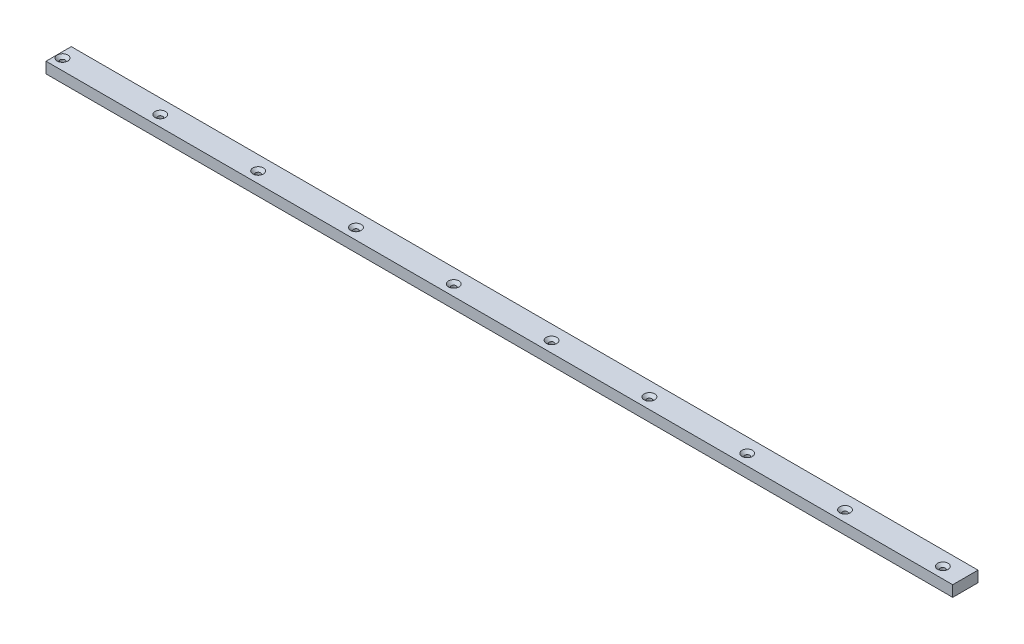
ISO-10303-21;
HEADER;
FILE_DESCRIPTION(('STEP AP214'),'2;1');
FILE_NAME('part.step','',(''),(''),'','','');
FILE_SCHEMA(('AUTOMOTIVE_DESIGN { 1 0 10303 214 1 1 1 1 }'));
ENDSEC;
DATA;
#1=APPLICATION_CONTEXT('core data for automotive mechanical design processes');
#2=APPLICATION_PROTOCOL_DEFINITION('international standard','automotive_design',2000,#1);
#3=PRODUCT_CONTEXT('',#1,'mechanical');
#4=PRODUCT('Part','Part','',(#3));
#5=PRODUCT_RELATED_PRODUCT_CATEGORY('part','',(#4));
#6=PRODUCT_DEFINITION_FORMATION('','',#4);
#7=PRODUCT_DEFINITION_CONTEXT('part definition',#1,'design');
#8=PRODUCT_DEFINITION('design','',#6,#7);
#9=PRODUCT_DEFINITION_SHAPE('','',#8);
#10=(LENGTH_UNIT() NAMED_UNIT(*) SI_UNIT(.MILLI.,.METRE.));
#11=(NAMED_UNIT(*) PLANE_ANGLE_UNIT() SI_UNIT($,.RADIAN.));
#12=(NAMED_UNIT(*) SI_UNIT($,.STERADIAN.) SOLID_ANGLE_UNIT());
#13=UNCERTAINTY_MEASURE_WITH_UNIT(LENGTH_MEASURE(1.E-05),#10,'distance_accuracy_value','');
#14=(GEOMETRIC_REPRESENTATION_CONTEXT(3) GLOBAL_UNCERTAINTY_ASSIGNED_CONTEXT((#13)) GLOBAL_UNIT_ASSIGNED_CONTEXT((#10,
#11,#12)) REPRESENTATION_CONTEXT('',''));
#15=CARTESIAN_POINT('',(0.,0.,0.));
#16=DIRECTION('',(0.,0.,1.));
#17=DIRECTION('',(1.,0.,0.));
#18=AXIS2_PLACEMENT_3D('',#15,#16,#17);
#19=CARTESIAN_POINT('',(-318.5,9.99999999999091,1.5));
#20=DIRECTION('',(0.,1.,0.));
#21=DIRECTION('',(0.,0.,1.));
#22=AXIS2_PLACEMENT_3D('',#19,#20,#21);
#23=CONICAL_SURFACE('',#22,4.79999999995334,0.785398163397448);
#24=CARTESIAN_POINT('',(-318.5,7.45,1.5));
#25=DIRECTION('',(0.,1.,0.));
#26=DIRECTION('',(0.,0.,1.));
#27=AXIS2_PLACEMENT_3D('',#24,#25,#26);
#28=CIRCLE('',#27,2.24999999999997);
#29=CARTESIAN_POINT('',(-318.5,7.45,3.74999999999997));
#30=VERTEX_POINT('',#29);
#31=EDGE_CURVE('E111',#30,#30,#28,.F.);
#32=ORIENTED_EDGE('',*,*,#31,.T.);
#33=EDGE_LOOP('',(#32));
#34=FACE_BOUND('',#33,.T.);
#35=CARTESIAN_POINT('',(-318.5,9.99999999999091,1.5));
#36=DIRECTION('',(0.,1.,0.));
#37=DIRECTION('',(0.,0.,1.));
#38=AXIS2_PLACEMENT_3D('',#35,#36,#37);
#39=CIRCLE('',#38,4.79999999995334);
#40=CARTESIAN_POINT('',(-318.5,9.99999999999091,6.29999999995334));
#41=VERTEX_POINT('',#40);
#42=EDGE_CURVE('E20',#41,#41,#39,.F.);
#43=ORIENTED_EDGE('',*,*,#42,.F.);
#44=EDGE_LOOP('',(#43));
#45=FACE_BOUND('',#44,.T.);
#46=ADVANCED_FACE('F17',(#34,#45),#23,.F.);
#47=CARTESIAN_POINT('',(-407.5,9.99999999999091,1.5));
#48=DIRECTION('',(0.,1.,0.));
#49=DIRECTION('',(0.,0.,1.));
#50=AXIS2_PLACEMENT_3D('',#47,#48,#49);
#51=CONICAL_SURFACE('',#50,4.79999999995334,0.785398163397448);
#52=CARTESIAN_POINT('',(-407.5,7.45,1.5));
#53=DIRECTION('',(0.,1.,0.));
#54=DIRECTION('',(0.,0.,1.));
#55=AXIS2_PLACEMENT_3D('',#52,#53,#54);
#56=CIRCLE('',#55,2.24999999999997);
#57=CARTESIAN_POINT('',(-407.5,7.45,3.74999999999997));
#58=VERTEX_POINT('',#57);
#59=EDGE_CURVE('E68',#58,#58,#56,.F.);
#60=ORIENTED_EDGE('',*,*,#59,.T.);
#61=EDGE_LOOP('',(#60));
#62=FACE_BOUND('',#61,.T.);
#63=CARTESIAN_POINT('',(-407.5,9.99999999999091,1.5));
#64=DIRECTION('',(0.,1.,0.));
#65=DIRECTION('',(0.,0.,1.));
#66=AXIS2_PLACEMENT_3D('',#63,#64,#65);
#67=CIRCLE('',#66,4.79999999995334);
#68=CARTESIAN_POINT('',(-407.5,9.99999999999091,6.29999999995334));
#69=VERTEX_POINT('',#68);
#70=EDGE_CURVE('E163',#69,#69,#67,.F.);
#71=ORIENTED_EDGE('',*,*,#70,.F.);
#72=EDGE_LOOP('',(#71));
#73=FACE_BOUND('',#72,.T.);
#74=ADVANCED_FACE('F171',(#62,#73),#51,.F.);
#75=CARTESIAN_POINT('',(0.,10.,0.));
#76=DIRECTION('',(0.,1.,0.));
#77=DIRECTION('',(0.,0.,1.));
#78=AXIS2_PLACEMENT_3D('',#75,#76,#77);
#79=PLANE('',#78);
#80=CARTESIAN_POINT('',(393.5,9.99999999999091,1.5));
#81=DIRECTION('',(0.,1.,0.));
#82=DIRECTION('',(0.,0.,1.));
#83=AXIS2_PLACEMENT_3D('',#80,#81,#82);
#84=CIRCLE('',#83,4.79999999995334);
#85=CARTESIAN_POINT('',(393.5,9.99999999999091,6.29999999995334));
#86=VERTEX_POINT('',#85);
#87=EDGE_CURVE('E113',#86,#86,#84,.F.);
#88=ORIENTED_EDGE('',*,*,#87,.T.);
#89=EDGE_LOOP('',(#88));
#90=FACE_BOUND('',#89,.T.);
#91=CARTESIAN_POINT('',(304.5,9.99999999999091,1.5));
#92=DIRECTION('',(0.,1.,0.));
#93=DIRECTION('',(0.,0.,1.));
#94=AXIS2_PLACEMENT_3D('',#91,#92,#93);
#95=CIRCLE('',#94,4.79999999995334);
#96=CARTESIAN_POINT('',(304.5,9.99999999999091,6.29999999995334));
#97=VERTEX_POINT('',#96);
#98=EDGE_CURVE('E143',#97,#97,#95,.F.);
#99=ORIENTED_EDGE('',*,*,#98,.T.);
#100=EDGE_LOOP('',(#99));
#101=FACE_BOUND('',#100,.T.);
#102=CARTESIAN_POINT('',(215.5,9.99999999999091,1.5));
#103=DIRECTION('',(0.,1.,0.));
#104=DIRECTION('',(0.,0.,1.));
#105=AXIS2_PLACEMENT_3D('',#102,#103,#104);
#106=CIRCLE('',#105,4.79999999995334);
#107=CARTESIAN_POINT('',(215.5,9.99999999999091,6.29999999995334));
#108=VERTEX_POINT('',#107);
#109=EDGE_CURVE('E146',#108,#108,#106,.F.);
#110=ORIENTED_EDGE('',*,*,#109,.T.);
#111=EDGE_LOOP('',(#110));
#112=FACE_BOUND('',#111,.T.);
#113=CARTESIAN_POINT('',(126.5,9.99999999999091,1.5));
#114=DIRECTION('',(0.,1.,0.));
#115=DIRECTION('',(0.,0.,1.));
#116=AXIS2_PLACEMENT_3D('',#113,#114,#115);
#117=CIRCLE('',#116,4.79999999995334);
#118=CARTESIAN_POINT('',(126.5,9.99999999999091,6.29999999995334));
#119=VERTEX_POINT('',#118);
#120=EDGE_CURVE('E149',#119,#119,#117,.F.);
#121=ORIENTED_EDGE('',*,*,#120,.T.);
#122=EDGE_LOOP('',(#121));
#123=FACE_BOUND('',#122,.T.);
#124=CARTESIAN_POINT('',(37.5000000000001,9.99999999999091,1.5));
#125=DIRECTION('',(0.,1.,0.));
#126=DIRECTION('',(0.,0.,1.));
#127=AXIS2_PLACEMENT_3D('',#124,#125,#126);
#128=CIRCLE('',#127,4.79999999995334);
#129=CARTESIAN_POINT('',(37.5000000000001,9.99999999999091,6.29999999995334));
#130=VERTEX_POINT('',#129);
#131=EDGE_CURVE('E152',#130,#130,#128,.F.);
#132=ORIENTED_EDGE('',*,*,#131,.T.);
#133=EDGE_LOOP('',(#132));
#134=FACE_BOUND('',#133,.T.);
#135=CARTESIAN_POINT('',(-51.4999999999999,9.99999999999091,1.5));
#136=DIRECTION('',(0.,1.,0.));
#137=DIRECTION('',(0.,0.,1.));
#138=AXIS2_PLACEMENT_3D('',#135,#136,#137);
#139=CIRCLE('',#138,4.79999999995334);
#140=CARTESIAN_POINT('',(-51.4999999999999,9.99999999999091,6.29999999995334));
#141=VERTEX_POINT('',#140);
#142=EDGE_CURVE('E155',#141,#141,#139,.F.);
#143=ORIENTED_EDGE('',*,*,#142,.T.);
#144=EDGE_LOOP('',(#143));
#145=FACE_BOUND('',#144,.T.);
#146=CARTESIAN_POINT('',(-140.5,9.99999999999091,1.5));
#147=DIRECTION('',(0.,1.,0.));
#148=DIRECTION('',(0.,0.,1.));
#149=AXIS2_PLACEMENT_3D('',#146,#147,#148);
#150=CIRCLE('',#149,4.79999999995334);
#151=CARTESIAN_POINT('',(-140.5,9.99999999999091,6.29999999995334));
#152=VERTEX_POINT('',#151);
#153=EDGE_CURVE('E158',#152,#152,#150,.F.);
#154=ORIENTED_EDGE('',*,*,#153,.T.);
#155=EDGE_LOOP('',(#154));
#156=FACE_BOUND('',#155,.T.);
#157=CARTESIAN_POINT('',(-229.5,9.99999999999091,1.5));
#158=DIRECTION('',(0.,1.,0.));
#159=DIRECTION('',(0.,0.,1.));
#160=AXIS2_PLACEMENT_3D('',#157,#158,#159);
#161=CIRCLE('',#160,4.79999999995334);
#162=CARTESIAN_POINT('',(-229.5,9.99999999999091,6.29999999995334));
#163=VERTEX_POINT('',#162);
#164=EDGE_CURVE('E161',#163,#163,#161,.F.);
#165=ORIENTED_EDGE('',*,*,#164,.T.);
#166=EDGE_LOOP('',(#165));
#167=FACE_BOUND('',#166,.T.);
#168=DIRECTION('',(0.,0.,-1.));
#169=VECTOR('',#168,1.);
#170=CARTESIAN_POINT('',(-412.5,10.,-11.5));
#171=LINE('',#170,#169);
#172=CARTESIAN_POINT('',(-412.5,10.,-11.5));
#173=VERTEX_POINT('',#172);
#174=CARTESIAN_POINT('',(-412.5,10.,11.5));
#175=VERTEX_POINT('',#174);
#176=EDGE_CURVE('E56',#173,#175,#171,.F.);
#177=ORIENTED_EDGE('',*,*,#176,.T.);
#178=DIRECTION('',(-1.,0.,0.));
#179=VECTOR('',#178,1.);
#180=CARTESIAN_POINT('',(-412.5,10.,11.5));
#181=LINE('',#180,#179);
#182=CARTESIAN_POINT('',(412.5,10.,11.5));
#183=VERTEX_POINT('',#182);
#184=EDGE_CURVE('E480',#175,#183,#181,.F.);
#185=ORIENTED_EDGE('',*,*,#184,.T.);
#186=DIRECTION('',(0.,0.,1.));
#187=VECTOR('',#186,1.);
#188=CARTESIAN_POINT('',(412.5,10.,-11.5));
#189=LINE('',#188,#187);
#190=CARTESIAN_POINT('',(412.5,10.,-11.5));
#191=VERTEX_POINT('',#190);
#192=EDGE_CURVE('E62',#183,#191,#189,.F.);
#193=ORIENTED_EDGE('',*,*,#192,.T.);
#194=DIRECTION('',(1.,0.,0.));
#195=VECTOR('',#194,1.);
#196=CARTESIAN_POINT('',(-412.5,10.,-11.5));
#197=LINE('',#196,#195);
#198=EDGE_CURVE('E59',#191,#173,#197,.F.);
#199=ORIENTED_EDGE('',*,*,#198,.T.);
#200=EDGE_LOOP('',(#177,#185,#193,#199));
#201=FACE_BOUND('',#200,.T.);
#202=ORIENTED_EDGE('',*,*,#70,.T.);
#203=EDGE_LOOP('',(#202));
#204=FACE_BOUND('',#203,.T.);
#205=ORIENTED_EDGE('',*,*,#42,.T.);
#206=EDGE_LOOP('',(#205));
#207=FACE_BOUND('',#206,.T.);
#208=ADVANCED_FACE('F60',(#90,#101,#112,#123,#134,#145,#156,#167,#201,#204,#207),#79,.T.);
#209=CARTESIAN_POINT('',(-229.5,9.99999999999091,1.5));
#210=DIRECTION('',(0.,1.,0.));
#211=DIRECTION('',(0.,0.,1.));
#212=AXIS2_PLACEMENT_3D('',#209,#210,#211);
#213=CONICAL_SURFACE('',#212,4.79999999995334,0.785398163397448);
#214=CARTESIAN_POINT('',(-229.5,7.45,1.5));
#215=DIRECTION('',(0.,1.,0.));
#216=DIRECTION('',(0.,0.,1.));
#217=AXIS2_PLACEMENT_3D('',#214,#215,#216);
#218=CIRCLE('',#217,2.24999999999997);
#219=CARTESIAN_POINT('',(-229.5,7.45,3.74999999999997));
#220=VERTEX_POINT('',#219);
#221=EDGE_CURVE('E105',#220,#220,#218,.F.);
#222=ORIENTED_EDGE('',*,*,#221,.T.);
#223=EDGE_LOOP('',(#222));
#224=FACE_BOUND('',#223,.T.);
#225=ORIENTED_EDGE('',*,*,#164,.F.);
#226=EDGE_LOOP('',(#225));
#227=FACE_BOUND('',#226,.T.);
#228=ADVANCED_FACE('F265',(#224,#227),#213,.F.);
#229=CARTESIAN_POINT('',(-140.5,9.99999999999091,1.5));
#230=DIRECTION('',(0.,1.,0.));
#231=DIRECTION('',(0.,0.,1.));
#232=AXIS2_PLACEMENT_3D('',#229,#230,#231);
#233=CONICAL_SURFACE('',#232,4.79999999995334,0.785398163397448);
#234=CARTESIAN_POINT('',(-140.5,7.45,1.5));
#235=DIRECTION('',(0.,1.,0.));
#236=DIRECTION('',(0.,0.,1.));
#237=AXIS2_PLACEMENT_3D('',#234,#235,#236);
#238=CIRCLE('',#237,2.24999999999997);
#239=CARTESIAN_POINT('',(-140.5,7.45,3.74999999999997));
#240=VERTEX_POINT('',#239);
#241=EDGE_CURVE('E102',#240,#240,#238,.F.);
#242=ORIENTED_EDGE('',*,*,#241,.T.);
#243=EDGE_LOOP('',(#242));
#244=FACE_BOUND('',#243,.T.);
#245=ORIENTED_EDGE('',*,*,#153,.F.);
#246=EDGE_LOOP('',(#245));
#247=FACE_BOUND('',#246,.T.);
#248=ADVANCED_FACE('F261',(#244,#247),#233,.F.);
#249=CARTESIAN_POINT('',(-51.4999999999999,9.99999999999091,1.5));
#250=DIRECTION('',(0.,1.,0.));
#251=DIRECTION('',(0.,0.,1.));
#252=AXIS2_PLACEMENT_3D('',#249,#250,#251);
#253=CONICAL_SURFACE('',#252,4.79999999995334,0.785398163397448);
#254=CARTESIAN_POINT('',(-51.4999999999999,7.45,1.5));
#255=DIRECTION('',(0.,1.,0.));
#256=DIRECTION('',(0.,0.,1.));
#257=AXIS2_PLACEMENT_3D('',#254,#255,#256);
#258=CIRCLE('',#257,2.24999999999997);
#259=CARTESIAN_POINT('',(-51.4999999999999,7.45,3.74999999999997));
#260=VERTEX_POINT('',#259);
#261=EDGE_CURVE('E99',#260,#260,#258,.F.);
#262=ORIENTED_EDGE('',*,*,#261,.T.);
#263=EDGE_LOOP('',(#262));
#264=FACE_BOUND('',#263,.T.);
#265=ORIENTED_EDGE('',*,*,#142,.F.);
#266=EDGE_LOOP('',(#265));
#267=FACE_BOUND('',#266,.T.);
#268=ADVANCED_FACE('F257',(#264,#267),#253,.F.);
#269=CARTESIAN_POINT('',(37.5000000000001,9.99999999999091,1.5));
#270=DIRECTION('',(0.,1.,0.));
#271=DIRECTION('',(0.,0.,1.));
#272=AXIS2_PLACEMENT_3D('',#269,#270,#271);
#273=CONICAL_SURFACE('',#272,4.79999999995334,0.785398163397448);
#274=CARTESIAN_POINT('',(37.5000000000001,7.45,1.5));
#275=DIRECTION('',(0.,1.,0.));
#276=DIRECTION('',(0.,0.,1.));
#277=AXIS2_PLACEMENT_3D('',#274,#275,#276);
#278=CIRCLE('',#277,2.24999999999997);
#279=CARTESIAN_POINT('',(37.5000000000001,7.45,3.74999999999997));
#280=VERTEX_POINT('',#279);
#281=EDGE_CURVE('E96',#280,#280,#278,.F.);
#282=ORIENTED_EDGE('',*,*,#281,.T.);
#283=EDGE_LOOP('',(#282));
#284=FACE_BOUND('',#283,.T.);
#285=ORIENTED_EDGE('',*,*,#131,.F.);
#286=EDGE_LOOP('',(#285));
#287=FACE_BOUND('',#286,.T.);
#288=ADVANCED_FACE('F253',(#284,#287),#273,.F.);
#289=CARTESIAN_POINT('',(126.5,9.99999999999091,1.5));
#290=DIRECTION('',(0.,1.,0.));
#291=DIRECTION('',(0.,0.,1.));
#292=AXIS2_PLACEMENT_3D('',#289,#290,#291);
#293=CONICAL_SURFACE('',#292,4.79999999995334,0.785398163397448);
#294=CARTESIAN_POINT('',(126.5,7.45,1.5));
#295=DIRECTION('',(0.,1.,0.));
#296=DIRECTION('',(0.,0.,1.));
#297=AXIS2_PLACEMENT_3D('',#294,#295,#296);
#298=CIRCLE('',#297,2.24999999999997);
#299=CARTESIAN_POINT('',(126.5,7.45,3.74999999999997));
#300=VERTEX_POINT('',#299);
#301=EDGE_CURVE('E93',#300,#300,#298,.F.);
#302=ORIENTED_EDGE('',*,*,#301,.T.);
#303=EDGE_LOOP('',(#302));
#304=FACE_BOUND('',#303,.T.);
#305=ORIENTED_EDGE('',*,*,#120,.F.);
#306=EDGE_LOOP('',(#305));
#307=FACE_BOUND('',#306,.T.);
#308=ADVANCED_FACE('F249',(#304,#307),#293,.F.);
#309=CARTESIAN_POINT('',(215.5,9.99999999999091,1.5));
#310=DIRECTION('',(0.,1.,0.));
#311=DIRECTION('',(0.,0.,1.));
#312=AXIS2_PLACEMENT_3D('',#309,#310,#311);
#313=CONICAL_SURFACE('',#312,4.79999999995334,0.785398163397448);
#314=CARTESIAN_POINT('',(215.5,7.45,1.5));
#315=DIRECTION('',(0.,1.,0.));
#316=DIRECTION('',(0.,0.,1.));
#317=AXIS2_PLACEMENT_3D('',#314,#315,#316);
#318=CIRCLE('',#317,2.24999999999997);
#319=CARTESIAN_POINT('',(215.5,7.45,3.74999999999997));
#320=VERTEX_POINT('',#319);
#321=EDGE_CURVE('E90',#320,#320,#318,.F.);
#322=ORIENTED_EDGE('',*,*,#321,.T.);
#323=EDGE_LOOP('',(#322));
#324=FACE_BOUND('',#323,.T.);
#325=ORIENTED_EDGE('',*,*,#109,.F.);
#326=EDGE_LOOP('',(#325));
#327=FACE_BOUND('',#326,.T.);
#328=ADVANCED_FACE('F245',(#324,#327),#313,.F.);
#329=CARTESIAN_POINT('',(304.5,9.99999999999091,1.5));
#330=DIRECTION('',(0.,1.,0.));
#331=DIRECTION('',(0.,0.,1.));
#332=AXIS2_PLACEMENT_3D('',#329,#330,#331);
#333=CONICAL_SURFACE('',#332,4.79999999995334,0.785398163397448);
#334=CARTESIAN_POINT('',(304.5,7.45,1.5));
#335=DIRECTION('',(0.,1.,0.));
#336=DIRECTION('',(0.,0.,1.));
#337=AXIS2_PLACEMENT_3D('',#334,#335,#336);
#338=CIRCLE('',#337,2.24999999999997);
#339=CARTESIAN_POINT('',(304.5,7.45,3.74999999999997));
#340=VERTEX_POINT('',#339);
#341=EDGE_CURVE('E87',#340,#340,#338,.F.);
#342=ORIENTED_EDGE('',*,*,#341,.T.);
#343=EDGE_LOOP('',(#342));
#344=FACE_BOUND('',#343,.T.);
#345=ORIENTED_EDGE('',*,*,#98,.F.);
#346=EDGE_LOOP('',(#345));
#347=FACE_BOUND('',#346,.T.);
#348=ADVANCED_FACE('F241',(#344,#347),#333,.F.);
#349=CARTESIAN_POINT('',(393.5,9.99999999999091,1.5));
#350=DIRECTION('',(0.,1.,0.));
#351=DIRECTION('',(0.,0.,1.));
#352=AXIS2_PLACEMENT_3D('',#349,#350,#351);
#353=CONICAL_SURFACE('',#352,4.79999999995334,0.785398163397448);
#354=CARTESIAN_POINT('',(393.5,7.45,1.5));
#355=DIRECTION('',(0.,1.,0.));
#356=DIRECTION('',(0.,0.,1.));
#357=AXIS2_PLACEMENT_3D('',#354,#355,#356);
#358=CIRCLE('',#357,2.24999999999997);
#359=CARTESIAN_POINT('',(393.5,7.45,3.74999999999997));
#360=VERTEX_POINT('',#359);
#361=EDGE_CURVE('E83',#360,#360,#358,.F.);
#362=ORIENTED_EDGE('',*,*,#361,.T.);
#363=EDGE_LOOP('',(#362));
#364=FACE_BOUND('',#363,.T.);
#365=ORIENTED_EDGE('',*,*,#87,.F.);
#366=EDGE_LOOP('',(#365));
#367=FACE_BOUND('',#366,.T.);
#368=ADVANCED_FACE('F237',(#364,#367),#353,.F.);
#369=CARTESIAN_POINT('',(-318.5,10.,1.5));
#370=DIRECTION('',(0.,1.,0.));
#371=DIRECTION('',(0.,0.,1.));
#372=AXIS2_PLACEMENT_3D('',#369,#370,#371);
#373=CYLINDRICAL_SURFACE('',#372,2.24999999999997);
#374=CARTESIAN_POINT('',(-318.5,0.,1.5));
#375=DIRECTION('',(0.,1.,0.));
#376=DIRECTION('',(0.,0.,1.));
#377=AXIS2_PLACEMENT_3D('',#374,#375,#376);
#378=CIRCLE('',#377,2.24999999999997);
#379=CARTESIAN_POINT('',(-318.5,0.,3.74999999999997));
#380=VERTEX_POINT('',#379);
#381=EDGE_CURVE('E86',#380,#380,#378,.F.);
#382=ORIENTED_EDGE('',*,*,#381,.T.);
#383=EDGE_LOOP('',(#382));
#384=FACE_BOUND('',#383,.T.);
#385=ORIENTED_EDGE('',*,*,#31,.F.);
#386=EDGE_LOOP('',(#385));
#387=FACE_BOUND('',#386,.T.);
#388=ADVANCED_FACE('F233',(#384,#387),#373,.F.);
#389=CARTESIAN_POINT('',(-407.5,10.,1.5));
#390=DIRECTION('',(0.,1.,0.));
#391=DIRECTION('',(0.,0.,1.));
#392=AXIS2_PLACEMENT_3D('',#389,#390,#391);
#393=CYLINDRICAL_SURFACE('',#392,2.24999999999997);
#394=CARTESIAN_POINT('',(-407.5,0.,1.5));
#395=DIRECTION('',(0.,1.,0.));
#396=DIRECTION('',(0.,0.,1.));
#397=AXIS2_PLACEMENT_3D('',#394,#395,#396);
#398=CIRCLE('',#397,2.24999999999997);
#399=CARTESIAN_POINT('',(-407.5,0.,3.74999999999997));
#400=VERTEX_POINT('',#399);
#401=EDGE_CURVE('E136',#400,#400,#398,.F.);
#402=ORIENTED_EDGE('',*,*,#401,.T.);
#403=EDGE_LOOP('',(#402));
#404=FACE_BOUND('',#403,.T.);
#405=ORIENTED_EDGE('',*,*,#59,.F.);
#406=EDGE_LOOP('',(#405));
#407=FACE_BOUND('',#406,.T.);
#408=ADVANCED_FACE('F230',(#404,#407),#393,.F.);
#409=CARTESIAN_POINT('',(-412.5,10.,-11.5));
#410=DIRECTION('',(0.,0.,1.));
#411=DIRECTION('',(1.,0.,0.));
#412=AXIS2_PLACEMENT_3D('',#409,#410,#411);
#413=PLANE('',#412);
#414=DIRECTION('',(0.,1.,0.));
#415=VECTOR('',#414,1.);
#416=CARTESIAN_POINT('',(-412.5,10.,-11.5));
#417=LINE('',#416,#415);
#418=CARTESIAN_POINT('',(-412.5,0.,-11.5));
#419=VERTEX_POINT('',#418);
#420=EDGE_CURVE('E67',#419,#173,#417,.T.);
#421=ORIENTED_EDGE('',*,*,#420,.T.);
#422=ORIENTED_EDGE('',*,*,#198,.F.);
#423=DIRECTION('',(0.,1.,0.));
#424=VECTOR('',#423,1.);
#425=CARTESIAN_POINT('',(412.5,10.,-11.5));
#426=LINE('',#425,#424);
#427=CARTESIAN_POINT('',(412.5,0.,-11.5));
#428=VERTEX_POINT('',#427);
#429=EDGE_CURVE('E108',#191,#428,#426,.F.);
#430=ORIENTED_EDGE('',*,*,#429,.T.);
#431=DIRECTION('',(1.,0.,0.));
#432=VECTOR('',#431,1.);
#433=CARTESIAN_POINT('',(0.,0.,-11.5));
#434=LINE('',#433,#432);
#435=EDGE_CURVE('E79',#428,#419,#434,.F.);
#436=ORIENTED_EDGE('',*,*,#435,.T.);
#437=EDGE_LOOP('',(#421,#422,#430,#436));
#438=FACE_BOUND('',#437,.T.);
#439=ADVANCED_FACE('F78',(#438),#413,.F.);
#440=CARTESIAN_POINT('',(-412.5,10.,-11.5));
#441=DIRECTION('',(1.,0.,0.));
#442=DIRECTION('',(0.,0.,-1.));
#443=AXIS2_PLACEMENT_3D('',#440,#441,#442);
#444=PLANE('',#443);
#445=DIRECTION('',(0.,1.,0.));
#446=VECTOR('',#445,1.);
#447=CARTESIAN_POINT('',(-412.5,10.,11.5));
#448=LINE('',#447,#446);
#449=CARTESIAN_POINT('',(-412.5,0.,11.5));
#450=VERTEX_POINT('',#449);
#451=EDGE_CURVE('E75',#450,#175,#448,.T.);
#452=ORIENTED_EDGE('',*,*,#451,.T.);
#453=ORIENTED_EDGE('',*,*,#176,.F.);
#454=ORIENTED_EDGE('',*,*,#420,.F.);
#455=DIRECTION('',(0.,0.,1.));
#456=VECTOR('',#455,1.);
#457=CARTESIAN_POINT('',(-412.5,0.,0.));
#458=LINE('',#457,#456);
#459=EDGE_CURVE('E489',#419,#450,#458,.T.);
#460=ORIENTED_EDGE('',*,*,#459,.T.);
#461=EDGE_LOOP('',(#452,#453,#454,#460));
#462=FACE_BOUND('',#461,.T.);
#463=ADVANCED_FACE('F72',(#462),#444,.F.);
#464=CARTESIAN_POINT('',(-412.5,10.,11.5));
#465=DIRECTION('',(0.,0.,-1.));
#466=DIRECTION('',(-1.,0.,0.));
#467=AXIS2_PLACEMENT_3D('',#464,#465,#466);
#468=PLANE('',#467);
#469=DIRECTION('',(0.,1.,0.));
#470=VECTOR('',#469,1.);
#471=CARTESIAN_POINT('',(412.5,10.,11.5));
#472=LINE('',#471,#470);
#473=CARTESIAN_POINT('',(412.5,0.,11.5));
#474=VERTEX_POINT('',#473);
#475=EDGE_CURVE('E35',#474,#183,#472,.T.);
#476=ORIENTED_EDGE('',*,*,#475,.T.);
#477=ORIENTED_EDGE('',*,*,#184,.F.);
#478=ORIENTED_EDGE('',*,*,#451,.F.);
#479=DIRECTION('',(1.,0.,0.));
#480=VECTOR('',#479,1.);
#481=CARTESIAN_POINT('',(0.,0.,11.5));
#482=LINE('',#481,#480);
#483=EDGE_CURVE('E482',#450,#474,#482,.T.);
#484=ORIENTED_EDGE('',*,*,#483,.T.);
#485=EDGE_LOOP('',(#476,#477,#478,#484));
#486=FACE_BOUND('',#485,.T.);
#487=ADVANCED_FACE('F222',(#486),#468,.F.);
#488=CARTESIAN_POINT('',(412.5,10.,-11.5));
#489=DIRECTION('',(-1.,0.,0.));
#490=DIRECTION('',(0.,0.,1.));
#491=AXIS2_PLACEMENT_3D('',#488,#489,#490);
#492=PLANE('',#491);
#493=ORIENTED_EDGE('',*,*,#429,.F.);
#494=ORIENTED_EDGE('',*,*,#192,.F.);
#495=ORIENTED_EDGE('',*,*,#475,.F.);
#496=DIRECTION('',(0.,0.,1.));
#497=VECTOR('',#496,1.);
#498=CARTESIAN_POINT('',(412.5,0.,0.));
#499=LINE('',#498,#497);
#500=EDGE_CURVE('E135',#474,#428,#499,.F.);
#501=ORIENTED_EDGE('',*,*,#500,.T.);
#502=EDGE_LOOP('',(#493,#494,#495,#501));
#503=FACE_BOUND('',#502,.T.);
#504=ADVANCED_FACE('F218',(#503),#492,.F.);
#505=CARTESIAN_POINT('',(-229.5,10.,1.5));
#506=DIRECTION('',(0.,1.,0.));
#507=DIRECTION('',(0.,0.,1.));
#508=AXIS2_PLACEMENT_3D('',#505,#506,#507);
#509=CYLINDRICAL_SURFACE('',#508,2.24999999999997);
#510=CARTESIAN_POINT('',(-229.5,0.,1.5));
#511=DIRECTION('',(0.,1.,0.));
#512=DIRECTION('',(0.,0.,1.));
#513=AXIS2_PLACEMENT_3D('',#510,#511,#512);
#514=CIRCLE('',#513,2.24999999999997);
#515=CARTESIAN_POINT('',(-229.5,0.,3.74999999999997));
#516=VERTEX_POINT('',#515);
#517=EDGE_CURVE('E132',#516,#516,#514,.F.);
#518=ORIENTED_EDGE('',*,*,#517,.T.);
#519=EDGE_LOOP('',(#518));
#520=FACE_BOUND('',#519,.T.);
#521=ORIENTED_EDGE('',*,*,#221,.F.);
#522=EDGE_LOOP('',(#521));
#523=FACE_BOUND('',#522,.T.);
#524=ADVANCED_FACE('F214',(#520,#523),#509,.F.);
#525=CARTESIAN_POINT('',(-140.5,10.,1.5));
#526=DIRECTION('',(0.,1.,0.));
#527=DIRECTION('',(0.,0.,1.));
#528=AXIS2_PLACEMENT_3D('',#525,#526,#527);
#529=CYLINDRICAL_SURFACE('',#528,2.24999999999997);
#530=CARTESIAN_POINT('',(-140.5,0.,1.5));
#531=DIRECTION('',(0.,1.,0.));
#532=DIRECTION('',(0.,0.,1.));
#533=AXIS2_PLACEMENT_3D('',#530,#531,#532);
#534=CIRCLE('',#533,2.24999999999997);
#535=CARTESIAN_POINT('',(-140.5,0.,3.74999999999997));
#536=VERTEX_POINT('',#535);
#537=EDGE_CURVE('E129',#536,#536,#534,.F.);
#538=ORIENTED_EDGE('',*,*,#537,.T.);
#539=EDGE_LOOP('',(#538));
#540=FACE_BOUND('',#539,.T.);
#541=ORIENTED_EDGE('',*,*,#241,.F.);
#542=EDGE_LOOP('',(#541));
#543=FACE_BOUND('',#542,.T.);
#544=ADVANCED_FACE('F210',(#540,#543),#529,.F.);
#545=CARTESIAN_POINT('',(-51.4999999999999,10.,1.5));
#546=DIRECTION('',(0.,1.,0.));
#547=DIRECTION('',(0.,0.,1.));
#548=AXIS2_PLACEMENT_3D('',#545,#546,#547);
#549=CYLINDRICAL_SURFACE('',#548,2.24999999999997);
#550=CARTESIAN_POINT('',(-51.4999999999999,0.,1.5));
#551=DIRECTION('',(0.,1.,0.));
#552=DIRECTION('',(0.,0.,1.));
#553=AXIS2_PLACEMENT_3D('',#550,#551,#552);
#554=CIRCLE('',#553,2.24999999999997);
#555=CARTESIAN_POINT('',(-51.4999999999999,0.,3.74999999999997));
#556=VERTEX_POINT('',#555);
#557=EDGE_CURVE('E126',#556,#556,#554,.F.);
#558=ORIENTED_EDGE('',*,*,#557,.T.);
#559=EDGE_LOOP('',(#558));
#560=FACE_BOUND('',#559,.T.);
#561=ORIENTED_EDGE('',*,*,#261,.F.);
#562=EDGE_LOOP('',(#561));
#563=FACE_BOUND('',#562,.T.);
#564=ADVANCED_FACE('F206',(#560,#563),#549,.F.);
#565=CARTESIAN_POINT('',(37.5000000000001,10.,1.5));
#566=DIRECTION('',(0.,1.,0.));
#567=DIRECTION('',(0.,0.,1.));
#568=AXIS2_PLACEMENT_3D('',#565,#566,#567);
#569=CYLINDRICAL_SURFACE('',#568,2.24999999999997);
#570=CARTESIAN_POINT('',(37.5000000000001,0.,1.5));
#571=DIRECTION('',(0.,1.,0.));
#572=DIRECTION('',(0.,0.,1.));
#573=AXIS2_PLACEMENT_3D('',#570,#571,#572);
#574=CIRCLE('',#573,2.24999999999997);
#575=CARTESIAN_POINT('',(37.5000000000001,0.,3.74999999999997));
#576=VERTEX_POINT('',#575);
#577=EDGE_CURVE('E123',#576,#576,#574,.F.);
#578=ORIENTED_EDGE('',*,*,#577,.T.);
#579=EDGE_LOOP('',(#578));
#580=FACE_BOUND('',#579,.T.);
#581=ORIENTED_EDGE('',*,*,#281,.F.);
#582=EDGE_LOOP('',(#581));
#583=FACE_BOUND('',#582,.T.);
#584=ADVANCED_FACE('F202',(#580,#583),#569,.F.);
#585=CARTESIAN_POINT('',(126.5,10.,1.5));
#586=DIRECTION('',(0.,1.,0.));
#587=DIRECTION('',(0.,0.,1.));
#588=AXIS2_PLACEMENT_3D('',#585,#586,#587);
#589=CYLINDRICAL_SURFACE('',#588,2.24999999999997);
#590=CARTESIAN_POINT('',(126.5,0.,1.5));
#591=DIRECTION('',(0.,1.,0.));
#592=DIRECTION('',(0.,0.,1.));
#593=AXIS2_PLACEMENT_3D('',#590,#591,#592);
#594=CIRCLE('',#593,2.24999999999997);
#595=CARTESIAN_POINT('',(126.5,0.,3.74999999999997));
#596=VERTEX_POINT('',#595);
#597=EDGE_CURVE('E120',#596,#596,#594,.F.);
#598=ORIENTED_EDGE('',*,*,#597,.T.);
#599=EDGE_LOOP('',(#598));
#600=FACE_BOUND('',#599,.T.);
#601=ORIENTED_EDGE('',*,*,#301,.F.);
#602=EDGE_LOOP('',(#601));
#603=FACE_BOUND('',#602,.T.);
#604=ADVANCED_FACE('F198',(#600,#603),#589,.F.);
#605=CARTESIAN_POINT('',(215.5,10.,1.5));
#606=DIRECTION('',(0.,1.,0.));
#607=DIRECTION('',(0.,0.,1.));
#608=AXIS2_PLACEMENT_3D('',#605,#606,#607);
#609=CYLINDRICAL_SURFACE('',#608,2.24999999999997);
#610=CARTESIAN_POINT('',(215.5,0.,1.5));
#611=DIRECTION('',(0.,1.,0.));
#612=DIRECTION('',(0.,0.,1.));
#613=AXIS2_PLACEMENT_3D('',#610,#611,#612);
#614=CIRCLE('',#613,2.24999999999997);
#615=CARTESIAN_POINT('',(215.5,0.,3.74999999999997));
#616=VERTEX_POINT('',#615);
#617=EDGE_CURVE('E117',#616,#616,#614,.F.);
#618=ORIENTED_EDGE('',*,*,#617,.T.);
#619=EDGE_LOOP('',(#618));
#620=FACE_BOUND('',#619,.T.);
#621=ORIENTED_EDGE('',*,*,#321,.F.);
#622=EDGE_LOOP('',(#621));
#623=FACE_BOUND('',#622,.T.);
#624=ADVANCED_FACE('F194',(#620,#623),#609,.F.);
#625=CARTESIAN_POINT('',(304.5,10.,1.5));
#626=DIRECTION('',(0.,1.,0.));
#627=DIRECTION('',(0.,0.,1.));
#628=AXIS2_PLACEMENT_3D('',#625,#626,#627);
#629=CYLINDRICAL_SURFACE('',#628,2.24999999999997);
#630=CARTESIAN_POINT('',(304.5,0.,1.5));
#631=DIRECTION('',(0.,1.,0.));
#632=DIRECTION('',(0.,0.,1.));
#633=AXIS2_PLACEMENT_3D('',#630,#631,#632);
#634=CIRCLE('',#633,2.24999999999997);
#635=CARTESIAN_POINT('',(304.5,0.,3.74999999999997));
#636=VERTEX_POINT('',#635);
#637=EDGE_CURVE('E26',#636,#636,#634,.F.);
#638=ORIENTED_EDGE('',*,*,#637,.T.);
#639=EDGE_LOOP('',(#638));
#640=FACE_BOUND('',#639,.T.);
#641=ORIENTED_EDGE('',*,*,#341,.F.);
#642=EDGE_LOOP('',(#641));
#643=FACE_BOUND('',#642,.T.);
#644=ADVANCED_FACE('F186',(#640,#643),#629,.F.);
#645=CARTESIAN_POINT('',(393.5,10.,1.5));
#646=DIRECTION('',(0.,1.,0.));
#647=DIRECTION('',(0.,0.,1.));
#648=AXIS2_PLACEMENT_3D('',#645,#646,#647);
#649=CYLINDRICAL_SURFACE('',#648,2.24999999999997);
#650=CARTESIAN_POINT('',(393.5,0.,1.5));
#651=DIRECTION('',(0.,1.,0.));
#652=DIRECTION('',(0.,0.,1.));
#653=AXIS2_PLACEMENT_3D('',#650,#651,#652);
#654=CIRCLE('',#653,2.24999999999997);
#655=CARTESIAN_POINT('',(393.5,0.,3.74999999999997));
#656=VERTEX_POINT('',#655);
#657=EDGE_CURVE('E11',#656,#656,#654,.F.);
#658=ORIENTED_EDGE('',*,*,#657,.T.);
#659=EDGE_LOOP('',(#658));
#660=FACE_BOUND('',#659,.T.);
#661=ORIENTED_EDGE('',*,*,#361,.F.);
#662=EDGE_LOOP('',(#661));
#663=FACE_BOUND('',#662,.T.);
#664=ADVANCED_FACE('F180',(#660,#663),#649,.F.);
#665=CARTESIAN_POINT('',(0.,0.,0.));
#666=DIRECTION('',(0.,1.,0.));
#667=DIRECTION('',(0.,0.,1.));
#668=AXIS2_PLACEMENT_3D('',#665,#666,#667);
#669=PLANE('',#668);
#670=ORIENTED_EDGE('',*,*,#657,.F.);
#671=EDGE_LOOP('',(#670));
#672=FACE_BOUND('',#671,.T.);
#673=ORIENTED_EDGE('',*,*,#637,.F.);
#674=EDGE_LOOP('',(#673));
#675=FACE_BOUND('',#674,.T.);
#676=ORIENTED_EDGE('',*,*,#617,.F.);
#677=EDGE_LOOP('',(#676));
#678=FACE_BOUND('',#677,.T.);
#679=ORIENTED_EDGE('',*,*,#597,.F.);
#680=EDGE_LOOP('',(#679));
#681=FACE_BOUND('',#680,.T.);
#682=ORIENTED_EDGE('',*,*,#577,.F.);
#683=EDGE_LOOP('',(#682));
#684=FACE_BOUND('',#683,.T.);
#685=ORIENTED_EDGE('',*,*,#557,.F.);
#686=EDGE_LOOP('',(#685));
#687=FACE_BOUND('',#686,.T.);
#688=ORIENTED_EDGE('',*,*,#537,.F.);
#689=EDGE_LOOP('',(#688));
#690=FACE_BOUND('',#689,.T.);
#691=ORIENTED_EDGE('',*,*,#517,.F.);
#692=EDGE_LOOP('',(#691));
#693=FACE_BOUND('',#692,.T.);
#694=ORIENTED_EDGE('',*,*,#483,.F.);
#695=ORIENTED_EDGE('',*,*,#459,.F.);
#696=ORIENTED_EDGE('',*,*,#435,.F.);
#697=ORIENTED_EDGE('',*,*,#500,.F.);
#698=EDGE_LOOP('',(#694,#695,#696,#697));
#699=FACE_BOUND('',#698,.T.);
#700=ORIENTED_EDGE('',*,*,#401,.F.);
#701=EDGE_LOOP('',(#700));
#702=FACE_BOUND('',#701,.T.);
#703=ORIENTED_EDGE('',*,*,#381,.F.);
#704=EDGE_LOOP('',(#703));
#705=FACE_BOUND('',#704,.T.);
#706=ADVANCED_FACE('F178',(#672,#675,#678,#681,#684,#687,#690,#693,#699,#702,#705),#669,.F.);
#707=CLOSED_SHELL('',(#46,#74,#208,#228,#248,#268,#288,#308,#328,#348,#368,#388,#408,#439,#463,
#487,#504,#524,#544,#564,#584,#604,#624,#644,#664,#706));
#708=MANIFOLD_SOLID_BREP('B1',#707);
#709=ADVANCED_BREP_SHAPE_REPRESENTATION('',(#18,#708),#14);
#710=SHAPE_DEFINITION_REPRESENTATION(#9,#709);
ENDSEC;
END-ISO-10303-21;
